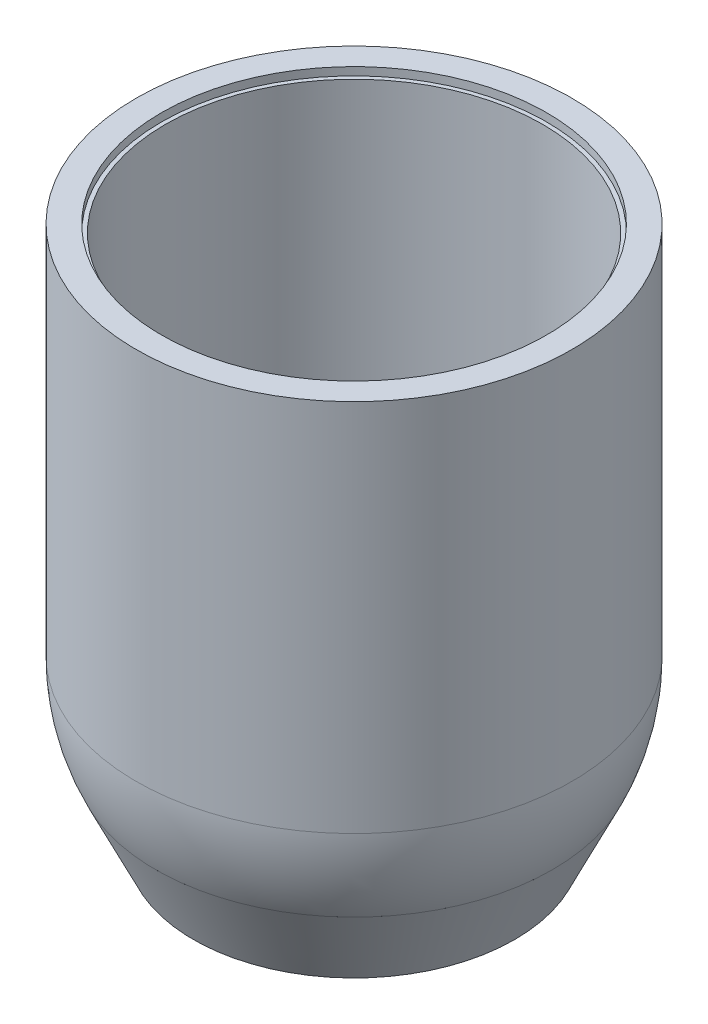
ISO-10303-21;
HEADER;
FILE_DESCRIPTION(('STEP AP214'),'2;1');
FILE_NAME('part.step','',(''),(''),'','','');
FILE_SCHEMA(('AUTOMOTIVE_DESIGN { 1 0 10303 214 1 1 1 1 }'));
ENDSEC;
DATA;
#1=APPLICATION_CONTEXT('core data for automotive mechanical design processes');
#2=APPLICATION_PROTOCOL_DEFINITION('international standard','automotive_design',2000,#1);
#3=PRODUCT_CONTEXT('',#1,'mechanical');
#4=PRODUCT('Part','Part','',(#3));
#5=PRODUCT_RELATED_PRODUCT_CATEGORY('part','',(#4));
#6=PRODUCT_DEFINITION_FORMATION('','',#4);
#7=PRODUCT_DEFINITION_CONTEXT('part definition',#1,'design');
#8=PRODUCT_DEFINITION('design','',#6,#7);
#9=PRODUCT_DEFINITION_SHAPE('','',#8);
#10=(LENGTH_UNIT() NAMED_UNIT(*) SI_UNIT(.MILLI.,.METRE.));
#11=(NAMED_UNIT(*) PLANE_ANGLE_UNIT() SI_UNIT($,.RADIAN.));
#12=(NAMED_UNIT(*) SI_UNIT($,.STERADIAN.) SOLID_ANGLE_UNIT());
#13=UNCERTAINTY_MEASURE_WITH_UNIT(LENGTH_MEASURE(1.E-05),#10,'distance_accuracy_value','');
#14=(GEOMETRIC_REPRESENTATION_CONTEXT(3) GLOBAL_UNCERTAINTY_ASSIGNED_CONTEXT((#13)) GLOBAL_UNIT_ASSIGNED_CONTEXT((#10,
#11,#12)) REPRESENTATION_CONTEXT('',''));
#15=CARTESIAN_POINT('',(0.,0.,0.));
#16=DIRECTION('',(0.,0.,1.));
#17=DIRECTION('',(1.,0.,0.));
#18=AXIS2_PLACEMENT_3D('',#15,#16,#17);
#19=CARTESIAN_POINT('',(0.,0.,0.));
#20=DIRECTION('',(0.,1.,0.));
#21=DIRECTION('',(-1.,0.,0.));
#22=AXIS2_PLACEMENT_3D('',#19,#20,#21);
#23=PLANE('',#22);
#24=CARTESIAN_POINT('',(108.,0.,0.));
#25=DIRECTION('',(0.,1.,0.));
#26=DIRECTION('',(-1.,0.,0.));
#27=AXIS2_PLACEMENT_3D('',#24,#25,#26);
#28=CIRCLE('',#27,108.);
#29=CARTESIAN_POINT('',(0.,0.,0.));
#30=VERTEX_POINT('',#29);
#31=EDGE_CURVE('E10',#30,#30,#28,.T.);
#32=ORIENTED_EDGE('',*,*,#31,.T.);
#33=EDGE_LOOP('',(#32));
#34=FACE_BOUND('',#33,.T.);
#35=CARTESIAN_POINT('',(108.,0.,0.));
#36=DIRECTION('',(0.,1.,0.));
#37=DIRECTION('',(-1.,0.,0.));
#38=AXIS2_PLACEMENT_3D('',#35,#36,#37);
#39=CIRCLE('',#38,95.4999999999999);
#40=CARTESIAN_POINT('',(12.5,0.,0.));
#41=VERTEX_POINT('',#40);
#42=EDGE_CURVE('E78',#41,#41,#39,.T.);
#43=ORIENTED_EDGE('',*,*,#42,.F.);
#44=EDGE_LOOP('',(#43));
#45=FACE_BOUND('',#44,.T.);
#46=ADVANCED_FACE('F32',(#34,#45),#23,.T.);
#47=CARTESIAN_POINT('',(108.,121.933306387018,0.));
#48=DIRECTION('',(0.,1.,0.));
#49=DIRECTION('',(-1.,0.,0.));
#50=AXIS2_PLACEMENT_3D('',#47,#48,#49);
#51=CYLINDRICAL_SURFACE('',#50,108.);
#52=CARTESIAN_POINT('',(108.,-185.45,0.));
#53=DIRECTION('',(0.,1.,0.));
#54=DIRECTION('',(-1.,0.,0.));
#55=AXIS2_PLACEMENT_3D('',#52,#53,#54);
#56=CIRCLE('',#55,108.);
#57=CARTESIAN_POINT('',(0.,-185.45,0.));
#58=VERTEX_POINT('',#57);
#59=EDGE_CURVE('E38',#58,#58,#56,.T.);
#60=ORIENTED_EDGE('',*,*,#59,.T.);
#61=EDGE_LOOP('',(#60));
#62=FACE_BOUND('',#61,.T.);
#63=ORIENTED_EDGE('',*,*,#31,.F.);
#64=EDGE_LOOP('',(#63));
#65=FACE_BOUND('',#64,.T.);
#66=ADVANCED_FACE('F86',(#62,#65),#51,.T.);
#67=CARTESIAN_POINT('',(108.,-185.45,0.));
#68=DIRECTION('',(0.,1.,0.));
#69=DIRECTION('',(-1.,0.,0.));
#70=AXIS2_PLACEMENT_3D('',#67,#68,#69);
#71=DEGENERATE_TOROIDAL_SURFACE('',#70,8.49999999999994,99.5,.T.);
#72=CARTESIAN_POINT('',(108.,-228.14951090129,0.));
#73=DIRECTION('',(0.,1.,0.));
#74=DIRECTION('',(-1.,0.,0.));
#75=AXIS2_PLACEMENT_3D('',#72,#73,#74);
#76=CIRCLE('',#75,98.3721412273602);
#77=CARTESIAN_POINT('',(9.62785877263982,-228.14951090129,0.));
#78=VERTEX_POINT('',#77);
#79=EDGE_CURVE('E42',#78,#78,#76,.T.);
#80=ORIENTED_EDGE('',*,*,#79,.T.);
#81=EDGE_LOOP('',(#80));
#82=FACE_BOUND('',#81,.T.);
#83=ORIENTED_EDGE('',*,*,#59,.F.);
#84=EDGE_LOOP('',(#83));
#85=FACE_BOUND('',#84,.T.);
#86=ADVANCED_FACE('F90',(#82,#85),#71,.T.);
#87=CARTESIAN_POINT('',(108.,-228.14951090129,0.));
#88=DIRECTION('',(0.,-1.,0.));
#89=DIRECTION('',(1.,0.,0.));
#90=AXIS2_PLACEMENT_3D('',#87,#88,#89);
#91=CONICAL_SURFACE('',#90,98.3721412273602,1.12730816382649);
#92=CARTESIAN_POINT('',(108.,-228.15,0.));
#93=DIRECTION('',(0.,1.,0.));
#94=DIRECTION('',(-1.,0.,0.));
#95=AXIS2_PLACEMENT_3D('',#92,#93,#94);
#96=CIRCLE('',#95,98.3731708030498);
#97=CARTESIAN_POINT('',(9.62682919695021,-228.15,0.));
#98=VERTEX_POINT('',#97);
#99=EDGE_CURVE('E46',#98,#98,#96,.T.);
#100=ORIENTED_EDGE('',*,*,#99,.T.);
#101=EDGE_LOOP('',(#100));
#102=FACE_BOUND('',#101,.T.);
#103=ORIENTED_EDGE('',*,*,#79,.F.);
#104=EDGE_LOOP('',(#103));
#105=FACE_BOUND('',#104,.T.);
#106=ADVANCED_FACE('F94',(#102,#105),#91,.T.);
#107=CARTESIAN_POINT('',(108.,-228.15,0.));
#108=DIRECTION('',(0.,1.,0.));
#109=DIRECTION('',(-1.,0.,0.));
#110=AXIS2_PLACEMENT_3D('',#107,#108,#109);
#111=CONICAL_SURFACE('',#110,98.3731708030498,0.443488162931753);
#112=CARTESIAN_POINT('',(108.,-267.5,0.));
#113=DIRECTION('',(0.,1.,0.));
#114=DIRECTION('',(-1.,0.,0.));
#115=AXIS2_PLACEMENT_3D('',#112,#113,#114);
#116=CIRCLE('',#115,79.6799999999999);
#117=CARTESIAN_POINT('',(28.32,-267.5,0.));
#118=VERTEX_POINT('',#117);
#119=EDGE_CURVE('E51',#118,#118,#116,.T.);
#120=ORIENTED_EDGE('',*,*,#119,.T.);
#121=EDGE_LOOP('',(#120));
#122=FACE_BOUND('',#121,.T.);
#123=ORIENTED_EDGE('',*,*,#99,.F.);
#124=EDGE_LOOP('',(#123));
#125=FACE_BOUND('',#124,.T.);
#126=ADVANCED_FACE('F101',(#122,#125),#111,.T.);
#127=CARTESIAN_POINT('',(28.32,-267.5,0.));
#128=DIRECTION('',(0.,-1.,0.));
#129=DIRECTION('',(1.,0.,0.));
#130=AXIS2_PLACEMENT_3D('',#127,#128,#129);
#131=PLANE('',#130);
#132=CARTESIAN_POINT('',(108.,-267.5,0.));
#133=DIRECTION('',(0.,1.,0.));
#134=DIRECTION('',(-1.,0.,0.));
#135=AXIS2_PLACEMENT_3D('',#132,#133,#134);
#136=CIRCLE('',#135,74.7121790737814);
#137=CARTESIAN_POINT('',(33.2878209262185,-267.5,0.));
#138=VERTEX_POINT('',#137);
#139=EDGE_CURVE('E54',#138,#138,#136,.T.);
#140=ORIENTED_EDGE('',*,*,#139,.T.);
#141=EDGE_LOOP('',(#140));
#142=FACE_BOUND('',#141,.T.);
#143=ORIENTED_EDGE('',*,*,#119,.F.);
#144=EDGE_LOOP('',(#143));
#145=FACE_BOUND('',#144,.T.);
#146=ADVANCED_FACE('F105',(#142,#145),#131,.T.);
#147=CARTESIAN_POINT('',(108.,-263.5,0.));
#148=DIRECTION('',(0.,1.,0.));
#149=DIRECTION('',(-1.,0.,0.));
#150=AXIS2_PLACEMENT_3D('',#147,#148,#149);
#151=TOROIDAL_SURFACE('',#150,71.7121790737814,4.99999999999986);
#152=CARTESIAN_POINT('',(108.,-265.116284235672,0.));
#153=DIRECTION('',(0.,1.,0.));
#154=DIRECTION('',(-1.,0.,0.));
#155=AXIS2_PLACEMENT_3D('',#152,#153,#154);
#156=CIRCLE('',#155,76.4437354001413);
#157=CARTESIAN_POINT('',(31.5562645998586,-265.116284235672,0.));
#158=VERTEX_POINT('',#157);
#159=EDGE_CURVE('E57',#158,#158,#156,.T.);
#160=ORIENTED_EDGE('',*,*,#159,.T.);
#161=EDGE_LOOP('',(#160));
#162=FACE_BOUND('',#161,.T.);
#163=ORIENTED_EDGE('',*,*,#139,.F.);
#164=EDGE_LOOP('',(#163));
#165=FACE_BOUND('',#164,.T.);
#166=ADVANCED_FACE('F109',(#162,#165),#151,.F.);
#167=CARTESIAN_POINT('',(108.,-265.116284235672,0.));
#168=DIRECTION('',(0.,1.,0.));
#169=DIRECTION('',(-1.,0.,0.));
#170=AXIS2_PLACEMENT_3D('',#167,#168,#169);
#171=CONICAL_SURFACE('',#170,76.4437354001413,0.329169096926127);
#172=CARTESIAN_POINT('',(108.,-210.116284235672,0.));
#173=DIRECTION('',(0.,1.,0.));
#174=DIRECTION('',(-1.,0.,0.));
#175=AXIS2_PLACEMENT_3D('',#172,#173,#174);
#176=CIRCLE('',#175,95.23155632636);
#177=CARTESIAN_POINT('',(12.76844367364,-210.116284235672,0.));
#178=VERTEX_POINT('',#177);
#179=EDGE_CURVE('E60',#178,#178,#176,.T.);
#180=ORIENTED_EDGE('',*,*,#179,.T.);
#181=EDGE_LOOP('',(#180));
#182=FACE_BOUND('',#181,.T.);
#183=ORIENTED_EDGE('',*,*,#159,.F.);
#184=EDGE_LOOP('',(#183));
#185=FACE_BOUND('',#184,.T.);
#186=ADVANCED_FACE('F113',(#182,#185),#171,.F.);
#187=CARTESIAN_POINT('',(108.,-208.5,0.));
#188=DIRECTION('',(0.,1.,0.));
#189=DIRECTION('',(-1.,0.,0.));
#190=AXIS2_PLACEMENT_3D('',#187,#188,#189);
#191=TOROIDAL_SURFACE('',#190,90.5,5.);
#192=CARTESIAN_POINT('',(108.,-208.5,0.));
#193=DIRECTION('',(0.,1.,0.));
#194=DIRECTION('',(-1.,0.,0.));
#195=AXIS2_PLACEMENT_3D('',#192,#193,#194);
#196=CIRCLE('',#195,95.4999999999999);
#197=CARTESIAN_POINT('',(12.5,-208.5,0.));
#198=VERTEX_POINT('',#197);
#199=EDGE_CURVE('E63',#198,#198,#196,.T.);
#200=ORIENTED_EDGE('',*,*,#199,.T.);
#201=EDGE_LOOP('',(#200));
#202=FACE_BOUND('',#201,.T.);
#203=ORIENTED_EDGE('',*,*,#179,.F.);
#204=EDGE_LOOP('',(#203));
#205=FACE_BOUND('',#204,.T.);
#206=ADVANCED_FACE('F117',(#202,#205),#191,.F.);
#207=CARTESIAN_POINT('',(108.,121.933306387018,0.));
#208=DIRECTION('',(0.,1.,0.));
#209=DIRECTION('',(-1.,0.,0.));
#210=AXIS2_PLACEMENT_3D('',#207,#208,#209);
#211=CYLINDRICAL_SURFACE('',#210,95.4999999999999);
#212=CARTESIAN_POINT('',(108.,-163.5,0.));
#213=DIRECTION('',(0.,1.,0.));
#214=DIRECTION('',(-1.,0.,0.));
#215=AXIS2_PLACEMENT_3D('',#212,#213,#214);
#216=CIRCLE('',#215,95.5);
#217=CARTESIAN_POINT('',(12.5,-163.5,0.));
#218=VERTEX_POINT('',#217);
#219=EDGE_CURVE('E66',#218,#218,#216,.T.);
#220=ORIENTED_EDGE('',*,*,#219,.T.);
#221=EDGE_LOOP('',(#220));
#222=FACE_BOUND('',#221,.T.);
#223=ORIENTED_EDGE('',*,*,#199,.F.);
#224=EDGE_LOOP('',(#223));
#225=FACE_BOUND('',#224,.T.);
#226=ADVANCED_FACE('F121',(#222,#225),#211,.F.);
#227=CARTESIAN_POINT('',(14.5,-163.5,0.));
#228=DIRECTION('',(0.,-1.,0.));
#229=DIRECTION('',(1.,0.,0.));
#230=AXIS2_PLACEMENT_3D('',#227,#228,#229);
#231=PLANE('',#230);
#232=CARTESIAN_POINT('',(108.,-163.5,0.));
#233=DIRECTION('',(0.,1.,0.));
#234=DIRECTION('',(-1.,0.,0.));
#235=AXIS2_PLACEMENT_3D('',#232,#233,#234);
#236=CIRCLE('',#235,93.4999999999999);
#237=CARTESIAN_POINT('',(14.5,-163.5,0.));
#238=VERTEX_POINT('',#237);
#239=EDGE_CURVE('E69',#238,#238,#236,.T.);
#240=ORIENTED_EDGE('',*,*,#239,.T.);
#241=EDGE_LOOP('',(#240));
#242=FACE_BOUND('',#241,.T.);
#243=ORIENTED_EDGE('',*,*,#219,.F.);
#244=EDGE_LOOP('',(#243));
#245=FACE_BOUND('',#244,.T.);
#246=ADVANCED_FACE('F125',(#242,#245),#231,.T.);
#247=CARTESIAN_POINT('',(108.,121.933306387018,0.));
#248=DIRECTION('',(0.,1.,0.));
#249=DIRECTION('',(-1.,0.,0.));
#250=AXIS2_PLACEMENT_3D('',#247,#248,#249);
#251=CYLINDRICAL_SURFACE('',#250,93.4999999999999);
#252=CARTESIAN_POINT('',(108.,-3.99999999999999,0.));
#253=DIRECTION('',(0.,1.,0.));
#254=DIRECTION('',(-1.,0.,0.));
#255=AXIS2_PLACEMENT_3D('',#252,#253,#254);
#256=CIRCLE('',#255,93.4999999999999);
#257=CARTESIAN_POINT('',(14.5,-4.,0.));
#258=VERTEX_POINT('',#257);
#259=EDGE_CURVE('E72',#258,#258,#256,.T.);
#260=ORIENTED_EDGE('',*,*,#259,.T.);
#261=EDGE_LOOP('',(#260));
#262=FACE_BOUND('',#261,.T.);
#263=ORIENTED_EDGE('',*,*,#239,.F.);
#264=EDGE_LOOP('',(#263));
#265=FACE_BOUND('',#264,.T.);
#266=ADVANCED_FACE('F129',(#262,#265),#251,.F.);
#267=CARTESIAN_POINT('',(12.5,-4.,0.));
#268=DIRECTION('',(0.,1.,0.));
#269=DIRECTION('',(-1.,0.,0.));
#270=AXIS2_PLACEMENT_3D('',#267,#268,#269);
#271=PLANE('',#270);
#272=CARTESIAN_POINT('',(108.,-3.99999999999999,0.));
#273=DIRECTION('',(0.,1.,0.));
#274=DIRECTION('',(-1.,0.,0.));
#275=AXIS2_PLACEMENT_3D('',#272,#273,#274);
#276=CIRCLE('',#275,95.4999999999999);
#277=CARTESIAN_POINT('',(12.5,-4.,0.));
#278=VERTEX_POINT('',#277);
#279=EDGE_CURVE('E75',#278,#278,#276,.T.);
#280=ORIENTED_EDGE('',*,*,#279,.T.);
#281=EDGE_LOOP('',(#280));
#282=FACE_BOUND('',#281,.T.);
#283=ORIENTED_EDGE('',*,*,#259,.F.);
#284=EDGE_LOOP('',(#283));
#285=FACE_BOUND('',#284,.T.);
#286=ADVANCED_FACE('F133',(#282,#285),#271,.T.);
#287=CARTESIAN_POINT('',(108.,121.933306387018,0.));
#288=DIRECTION('',(0.,1.,0.));
#289=DIRECTION('',(-1.,0.,0.));
#290=AXIS2_PLACEMENT_3D('',#287,#288,#289);
#291=CYLINDRICAL_SURFACE('',#290,95.4999999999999);
#292=ORIENTED_EDGE('',*,*,#42,.T.);
#293=EDGE_LOOP('',(#292));
#294=FACE_BOUND('',#293,.T.);
#295=ORIENTED_EDGE('',*,*,#279,.F.);
#296=EDGE_LOOP('',(#295));
#297=FACE_BOUND('',#296,.T.);
#298=ADVANCED_FACE('F82',(#294,#297),#291,.F.);
#299=CLOSED_SHELL('',(#46,#66,#86,#106,#126,#146,#166,#186,#206,#226,#246,#266,#286,#298));
#300=MANIFOLD_SOLID_BREP('B2',#299);
#301=ADVANCED_BREP_SHAPE_REPRESENTATION('',(#18,#300),#14);
#302=SHAPE_DEFINITION_REPRESENTATION(#9,#301);
ENDSEC;
END-ISO-10303-21;
